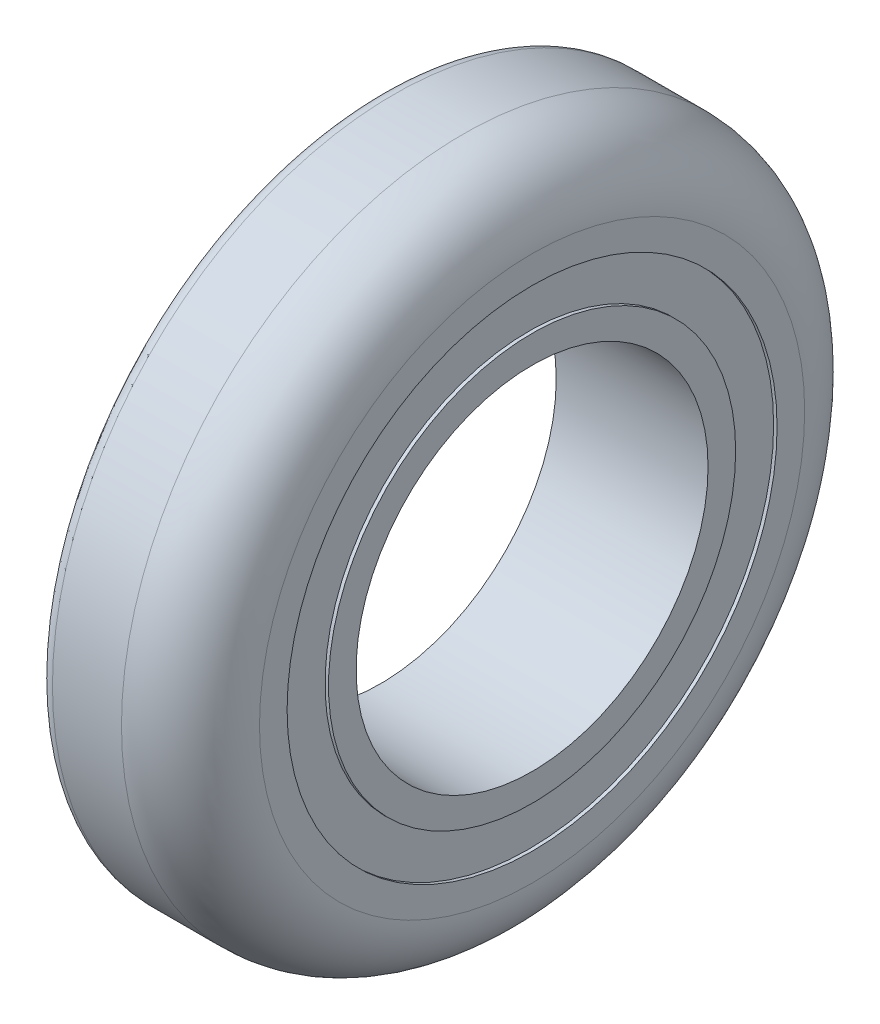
from build123d import *

# Parameters (mm, degrees)
SKETCH1_R           = 49.5
SKETCH1_R_2         = 25.5
BOSS_EXTRUDE1_DEPTH = 22
FILLET1_R           = 10
FILLET2_R           = 2
SKETCH2_R           = 35.5
SKETCH2_R_2         = 29.5
CUT_EXTRUDE1_DEPTH  = 0.5
CUT_EXTRUDE2_START  = -0.5
SKETCH3_R           = 35.5
SKETCH3_R_2         = 29.5
CUT_EXTRUDE2_DEPTH  = 0.5


with BuildPart() as part:
    # Sketch1 → Boss-Extrude1 (new body)
    with BuildSketch(Plane(origin=(0, 0, 0), x_dir=(0, 0, -1), z_dir=(1, 0, 0))):
        Circle(SKETCH1_R)
        Circle(SKETCH1_R_2, mode=Mode.SUBTRACT)
    extrude(amount=BOSS_EXTRUDE1_DEPTH)

    # Fillet1
    fillet1_edges = [part.edges().sort_by_distance(p)[0] for p in [
        (22, 0, 49.5),
    ]]
    fillet(fillet1_edges, radius=FILLET1_R)

    # Fillet2
    fillet2_edges = [part.edges().sort_by_distance(p)[0] for p in [
        (0, 0, 49.5),
    ]]
    fillet(fillet2_edges, radius=FILLET2_R)

    # Sketch2 → Cut-Extrude1 (cut)
    with BuildSketch(Plane(origin=(22, 0, 0), x_dir=(0, 0, -1), z_dir=(1, 0, 0))):
        Circle(SKETCH2_R)
        Circle(SKETCH2_R_2, mode=Mode.SUBTRACT)
    extrude(amount=-CUT_EXTRUDE1_DEPTH, mode=Mode.SUBTRACT)

    # Sketch3 → Cut-Extrude2 (cut)
    with BuildSketch(Plane.ZY.offset(CUT_EXTRUDE2_START)):
        with Locations(Location((0, 0, 0), (0, 0, 180))):
            Circle(SKETCH3_R)
        with Locations(Location((0, 0, 0), (0, 0, 180))):
            Circle(SKETCH3_R_2, mode=Mode.SUBTRACT)
    extrude(amount=CUT_EXTRUDE2_DEPTH, mode=Mode.SUBTRACT)


solid = part.part
